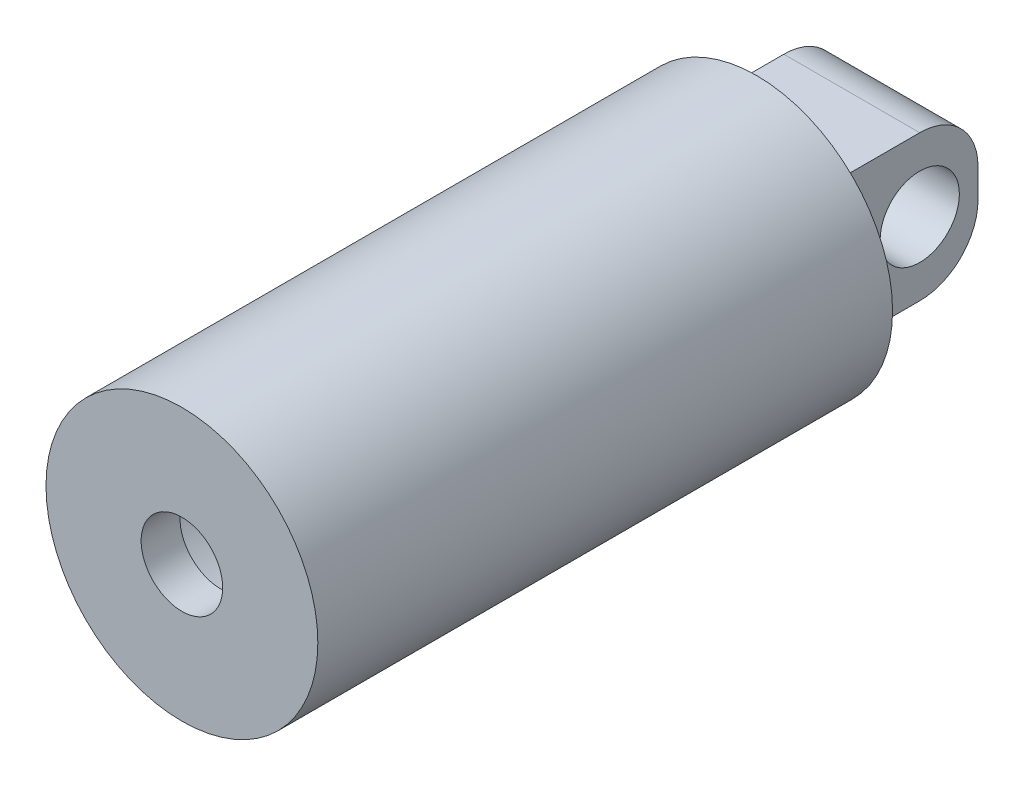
ISO-10303-21;
HEADER;
FILE_DESCRIPTION(('STEP AP214'),'2;1');
FILE_NAME('part.step','',(''),(''),'','','');
FILE_SCHEMA(('AUTOMOTIVE_DESIGN { 1 0 10303 214 1 1 1 1 }'));
ENDSEC;
DATA;
#1=APPLICATION_CONTEXT('core data for automotive mechanical design processes');
#2=APPLICATION_PROTOCOL_DEFINITION('international standard','automotive_design',2000,#1);
#3=PRODUCT_CONTEXT('',#1,'mechanical');
#4=PRODUCT('Part','Part','',(#3));
#5=PRODUCT_RELATED_PRODUCT_CATEGORY('part','',(#4));
#6=PRODUCT_DEFINITION_FORMATION('','',#4);
#7=PRODUCT_DEFINITION_CONTEXT('part definition',#1,'design');
#8=PRODUCT_DEFINITION('design','',#6,#7);
#9=PRODUCT_DEFINITION_SHAPE('','',#8);
#10=(LENGTH_UNIT() NAMED_UNIT(*) SI_UNIT(.MILLI.,.METRE.));
#11=(NAMED_UNIT(*) PLANE_ANGLE_UNIT() SI_UNIT($,.RADIAN.));
#12=(NAMED_UNIT(*) SI_UNIT($,.STERADIAN.) SOLID_ANGLE_UNIT());
#13=UNCERTAINTY_MEASURE_WITH_UNIT(LENGTH_MEASURE(1.E-05),#10,'distance_accuracy_value','');
#14=(GEOMETRIC_REPRESENTATION_CONTEXT(3) GLOBAL_UNCERTAINTY_ASSIGNED_CONTEXT((#13)) GLOBAL_UNIT_ASSIGNED_CONTEXT((#10,
#11,#12)) REPRESENTATION_CONTEXT('',''));
#15=CARTESIAN_POINT('',(0.,0.,0.));
#16=DIRECTION('',(0.,0.,1.));
#17=DIRECTION('',(1.,0.,0.));
#18=AXIS2_PLACEMENT_3D('',#15,#16,#17);
#19=CARTESIAN_POINT('',(0.,0.,-190.5));
#20=DIRECTION('',(0.,0.,1.));
#21=DIRECTION('',(1.,0.,0.));
#22=AXIS2_PLACEMENT_3D('',#19,#20,#21);
#23=CYLINDRICAL_SURFACE('',#22,44.45);
#24=CARTESIAN_POINT('',(0.,0.,0.));
#25=DIRECTION('',(0.,0.,1.));
#26=DIRECTION('',(1.,0.,0.));
#27=AXIS2_PLACEMENT_3D('',#24,#25,#26);
#28=CIRCLE('',#27,44.45);
#29=CARTESIAN_POINT('',(44.45,0.,0.));
#30=VERTEX_POINT('',#29);
#31=EDGE_CURVE('E142',#30,#30,#28,.T.);
#32=ORIENTED_EDGE('',*,*,#31,.F.);
#33=EDGE_LOOP('',(#32));
#34=FACE_BOUND('',#33,.T.);
#35=CARTESIAN_POINT('',(0.,0.,-187.96));
#36=DIRECTION('',(0.,0.,-1.));
#37=DIRECTION('',(-1.,0.,0.));
#38=AXIS2_PLACEMENT_3D('',#35,#36,#37);
#39=CIRCLE('',#38,44.45);
#40=CARTESIAN_POINT('',(-44.45,0.,-187.96));
#41=VERTEX_POINT('',#40);
#42=EDGE_CURVE('E114',#41,#41,#39,.T.);
#43=ORIENTED_EDGE('',*,*,#42,.F.);
#44=EDGE_LOOP('',(#43));
#45=FACE_BOUND('',#44,.T.);
#46=ADVANCED_FACE('F37',(#34,#45),#23,.T.);
#47=CARTESIAN_POINT('',(0.,0.,-190.5));
#48=DIRECTION('',(0.,0.,1.));
#49=DIRECTION('',(1.,0.,0.));
#50=AXIS2_PLACEMENT_3D('',#47,#48,#49);
#51=CYLINDRICAL_SURFACE('',#50,38.1);
#52=CARTESIAN_POINT('',(0.,0.,-12.7));
#53=DIRECTION('',(0.,0.,1.));
#54=DIRECTION('',(1.,0.,0.));
#55=AXIS2_PLACEMENT_3D('',#52,#53,#54);
#56=CIRCLE('',#55,38.1);
#57=CARTESIAN_POINT('',(38.1,0.,-12.7));
#58=VERTEX_POINT('',#57);
#59=EDGE_CURVE('E138',#58,#58,#56,.F.);
#60=ORIENTED_EDGE('',*,*,#59,.F.);
#61=EDGE_LOOP('',(#60));
#62=FACE_BOUND('',#61,.T.);
#63=CARTESIAN_POINT('',(0.,0.,-177.8));
#64=DIRECTION('',(0.,0.,-1.));
#65=DIRECTION('',(-1.,0.,0.));
#66=AXIS2_PLACEMENT_3D('',#63,#64,#65);
#67=CIRCLE('',#66,38.1);
#68=CARTESIAN_POINT('',(-38.1,0.,-177.8));
#69=VERTEX_POINT('',#68);
#70=EDGE_CURVE('E134',#69,#69,#67,.F.);
#71=ORIENTED_EDGE('',*,*,#70,.F.);
#72=EDGE_LOOP('',(#71));
#73=FACE_BOUND('',#72,.T.);
#74=ADVANCED_FACE('F185',(#62,#73),#51,.F.);
#75=CARTESIAN_POINT('',(0.,0.,0.));
#76=DIRECTION('',(0.,0.,1.));
#77=DIRECTION('',(1.,0.,0.));
#78=AXIS2_PLACEMENT_3D('',#75,#76,#77);
#79=PLANE('',#78);
#80=ORIENTED_EDGE('',*,*,#31,.T.);
#81=EDGE_LOOP('',(#80));
#82=FACE_BOUND('',#81,.T.);
#83=CARTESIAN_POINT('',(0.,0.,0.));
#84=DIRECTION('',(0.,0.,1.));
#85=DIRECTION('',(1.,0.,0.));
#86=AXIS2_PLACEMENT_3D('',#83,#84,#85);
#87=CIRCLE('',#86,13.335);
#88=CARTESIAN_POINT('',(13.335,0.,0.));
#89=VERTEX_POINT('',#88);
#90=EDGE_CURVE('E133',#89,#89,#87,.T.);
#91=ORIENTED_EDGE('',*,*,#90,.F.);
#92=EDGE_LOOP('',(#91));
#93=FACE_BOUND('',#92,.T.);
#94=ADVANCED_FACE('F193',(#82,#93),#79,.T.);
#95=CARTESIAN_POINT('',(0.,0.,-12.7));
#96=DIRECTION('',(0.,0.,1.));
#97=DIRECTION('',(1.,0.,0.));
#98=AXIS2_PLACEMENT_3D('',#95,#96,#97);
#99=PLANE('',#98);
#100=CARTESIAN_POINT('',(0.,0.,-12.7));
#101=DIRECTION('',(0.,0.,1.));
#102=DIRECTION('',(1.,0.,0.));
#103=AXIS2_PLACEMENT_3D('',#100,#101,#102);
#104=CIRCLE('',#103,13.335);
#105=CARTESIAN_POINT('',(13.335,0.,-12.7));
#106=VERTEX_POINT('',#105);
#107=EDGE_CURVE('E139',#106,#106,#104,.T.);
#108=ORIENTED_EDGE('',*,*,#107,.T.);
#109=EDGE_LOOP('',(#108));
#110=FACE_BOUND('',#109,.T.);
#111=ORIENTED_EDGE('',*,*,#59,.T.);
#112=EDGE_LOOP('',(#111));
#113=FACE_BOUND('',#112,.T.);
#114=ADVANCED_FACE('F225',(#110,#113),#99,.F.);
#115=CARTESIAN_POINT('',(0.,0.,-12.7));
#116=DIRECTION('',(0.,0.,1.));
#117=DIRECTION('',(1.,0.,0.));
#118=AXIS2_PLACEMENT_3D('',#115,#116,#117);
#119=CYLINDRICAL_SURFACE('',#118,13.335);
#120=ORIENTED_EDGE('',*,*,#107,.F.);
#121=EDGE_LOOP('',(#120));
#122=FACE_BOUND('',#121,.T.);
#123=ORIENTED_EDGE('',*,*,#90,.T.);
#124=EDGE_LOOP('',(#123));
#125=FACE_BOUND('',#124,.T.);
#126=ADVANCED_FACE('F219',(#122,#125),#119,.F.);
#127=CARTESIAN_POINT('',(0.,0.,-177.8));
#128=DIRECTION('',(0.,0.,-1.));
#129=DIRECTION('',(-1.,0.,0.));
#130=AXIS2_PLACEMENT_3D('',#127,#128,#129);
#131=PLANE('',#130);
#132=ORIENTED_EDGE('',*,*,#70,.T.);
#133=EDGE_LOOP('',(#132));
#134=FACE_BOUND('',#133,.T.);
#135=ADVANCED_FACE('F216',(#134),#131,.F.);
#136=CARTESIAN_POINT('',(0.,0.,-187.96));
#137=DIRECTION('',(0.,0.,-1.));
#138=DIRECTION('',(-1.,0.,0.));
#139=AXIS2_PLACEMENT_3D('',#136,#137,#138);
#140=PLANE('',#139);
#141=DIRECTION('',(1.,0.,0.));
#142=VECTOR('',#141,1.);
#143=CARTESIAN_POINT('',(-22.225,23.8125,-187.96));
#144=LINE('',#143,#142);
#145=CARTESIAN_POINT('',(-22.225,23.8125,-187.96));
#146=VERTEX_POINT('',#145);
#147=CARTESIAN_POINT('',(22.225,23.8125,-187.96));
#148=VERTEX_POINT('',#147);
#149=EDGE_CURVE('E112',#146,#148,#144,.T.);
#150=ORIENTED_EDGE('',*,*,#149,.F.);
#151=DIRECTION('',(0.,1.,0.));
#152=VECTOR('',#151,1.);
#153=CARTESIAN_POINT('',(-22.225,-23.8125,-187.96));
#154=LINE('',#153,#152);
#155=CARTESIAN_POINT('',(-22.225,-23.8125,-187.96));
#156=VERTEX_POINT('',#155);
#157=EDGE_CURVE('E106',#156,#146,#154,.T.);
#158=ORIENTED_EDGE('',*,*,#157,.F.);
#159=DIRECTION('',(-1.,0.,0.));
#160=VECTOR('',#159,1.);
#161=CARTESIAN_POINT('',(22.225,-23.8125,-187.96));
#162=LINE('',#161,#160);
#163=CARTESIAN_POINT('',(22.225,-23.8125,-187.96));
#164=VERTEX_POINT('',#163);
#165=EDGE_CURVE('E91',#164,#156,#162,.T.);
#166=ORIENTED_EDGE('',*,*,#165,.F.);
#167=DIRECTION('',(0.,-1.,0.));
#168=VECTOR('',#167,1.);
#169=CARTESIAN_POINT('',(22.225,23.8125,-187.96));
#170=LINE('',#169,#168);
#171=EDGE_CURVE('E103',#148,#164,#170,.T.);
#172=ORIENTED_EDGE('',*,*,#171,.F.);
#173=EDGE_LOOP('',(#150,#158,#166,#172));
#174=FACE_BOUND('',#173,.T.);
#175=ORIENTED_EDGE('',*,*,#42,.T.);
#176=EDGE_LOOP('',(#175));
#177=FACE_BOUND('',#176,.T.);
#178=ADVANCED_FACE('F101',(#174,#177),#140,.T.);
#179=CARTESIAN_POINT('',(0.,4.76249999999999,-219.075));
#180=DIRECTION('',(-1.,0.,0.));
#181=DIRECTION('',(0.,0.,1.));
#182=AXIS2_PLACEMENT_3D('',#179,#180,#181);
#183=CYLINDRICAL_SURFACE('',#182,19.05);
#184=CARTESIAN_POINT('',(-22.225,4.76249999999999,-219.075));
#185=DIRECTION('',(1.,0.,0.));
#186=DIRECTION('',(0.,1.,0.));
#187=AXIS2_PLACEMENT_3D('',#184,#185,#186);
#188=CIRCLE('',#187,19.05);
#189=CARTESIAN_POINT('',(-22.225,23.8125,-219.075));
#190=VERTEX_POINT('',#189);
#191=CARTESIAN_POINT('',(-22.225,4.76249999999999,-238.125));
#192=VERTEX_POINT('',#191);
#193=EDGE_CURVE('E154',#190,#192,#188,.F.);
#194=ORIENTED_EDGE('',*,*,#193,.F.);
#195=DIRECTION('',(1.,0.,0.));
#196=VECTOR('',#195,1.);
#197=CARTESIAN_POINT('',(-22.225,23.8125,-219.075));
#198=LINE('',#197,#196);
#199=CARTESIAN_POINT('',(22.225,23.8125,-219.075));
#200=VERTEX_POINT('',#199);
#201=EDGE_CURVE('E11',#200,#190,#198,.F.);
#202=ORIENTED_EDGE('',*,*,#201,.F.);
#203=CARTESIAN_POINT('',(22.225,4.76249999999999,-219.075));
#204=DIRECTION('',(-1.,0.,0.));
#205=DIRECTION('',(0.,-1.,0.));
#206=AXIS2_PLACEMENT_3D('',#203,#204,#205);
#207=CIRCLE('',#206,19.05);
#208=CARTESIAN_POINT('',(22.225,4.76249999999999,-238.125));
#209=VERTEX_POINT('',#208);
#210=EDGE_CURVE('E52',#209,#200,#207,.F.);
#211=ORIENTED_EDGE('',*,*,#210,.F.);
#212=DIRECTION('',(1.,0.,0.));
#213=VECTOR('',#212,1.);
#214=CARTESIAN_POINT('',(22.225,4.76249999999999,-238.125));
#215=LINE('',#214,#213);
#216=EDGE_CURVE('E137',#192,#209,#215,.T.);
#217=ORIENTED_EDGE('',*,*,#216,.F.);
#218=EDGE_LOOP('',(#194,#202,#211,#217));
#219=FACE_BOUND('',#218,.T.);
#220=ADVANCED_FACE('F39',(#219),#183,.T.);
#221=CARTESIAN_POINT('',(0.,0.,-238.125));
#222=DIRECTION('',(0.,0.,-1.));
#223=DIRECTION('',(-1.,0.,0.));
#224=AXIS2_PLACEMENT_3D('',#221,#222,#223);
#225=PLANE('',#224);
#226=DIRECTION('',(0.,-1.,0.));
#227=VECTOR('',#226,1.);
#228=CARTESIAN_POINT('',(22.225,23.8125,-238.125));
#229=LINE('',#228,#227);
#230=CARTESIAN_POINT('',(22.225,-4.76250000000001,-238.125));
#231=VERTEX_POINT('',#230);
#232=EDGE_CURVE('E126',#209,#231,#229,.T.);
#233=ORIENTED_EDGE('',*,*,#232,.T.);
#234=DIRECTION('',(-1.,0.,0.));
#235=VECTOR('',#234,1.);
#236=CARTESIAN_POINT('',(-22.225,-4.76250000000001,-238.125));
#237=LINE('',#236,#235);
#238=CARTESIAN_POINT('',(-22.225,-4.76250000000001,-238.125));
#239=VERTEX_POINT('',#238);
#240=EDGE_CURVE('E151',#231,#239,#237,.T.);
#241=ORIENTED_EDGE('',*,*,#240,.T.);
#242=DIRECTION('',(0.,1.,0.));
#243=VECTOR('',#242,1.);
#244=CARTESIAN_POINT('',(-22.225,23.8125,-238.125));
#245=LINE('',#244,#243);
#246=EDGE_CURVE('E123',#239,#192,#245,.T.);
#247=ORIENTED_EDGE('',*,*,#246,.T.);
#248=ORIENTED_EDGE('',*,*,#216,.T.);
#249=EDGE_LOOP('',(#233,#241,#247,#248));
#250=FACE_BOUND('',#249,.T.);
#251=ADVANCED_FACE('F162',(#250),#225,.T.);
#252=CARTESIAN_POINT('',(-32.385,0.,-219.075));
#253=DIRECTION('',(1.,0.,0.));
#254=DIRECTION('',(0.,1.,0.));
#255=AXIS2_PLACEMENT_3D('',#252,#253,#254);
#256=CYLINDRICAL_SURFACE('',#255,12.954);
#257=CARTESIAN_POINT('',(22.225,0.,-219.075));
#258=DIRECTION('',(1.,0.,0.));
#259=DIRECTION('',(0.,1.,0.));
#260=AXIS2_PLACEMENT_3D('',#257,#258,#259);
#261=CIRCLE('',#260,12.954);
#262=CARTESIAN_POINT('',(22.225,12.954,-219.075));
#263=VERTEX_POINT('',#262);
#264=EDGE_CURVE('E117',#263,#263,#261,.T.);
#265=ORIENTED_EDGE('',*,*,#264,.T.);
#266=EDGE_LOOP('',(#265));
#267=FACE_BOUND('',#266,.T.);
#268=CARTESIAN_POINT('',(-22.225,0.,-219.075));
#269=DIRECTION('',(1.,0.,0.));
#270=DIRECTION('',(0.,1.,0.));
#271=AXIS2_PLACEMENT_3D('',#268,#269,#270);
#272=CIRCLE('',#271,12.954);
#273=CARTESIAN_POINT('',(-22.225,12.954,-219.075));
#274=VERTEX_POINT('',#273);
#275=EDGE_CURVE('E120',#274,#274,#272,.T.);
#276=ORIENTED_EDGE('',*,*,#275,.F.);
#277=EDGE_LOOP('',(#276));
#278=FACE_BOUND('',#277,.T.);
#279=ADVANCED_FACE('F200',(#267,#278),#256,.F.);
#280=CARTESIAN_POINT('',(0.,-4.76250000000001,-219.075));
#281=DIRECTION('',(1.,0.,0.));
#282=DIRECTION('',(0.,0.,-1.));
#283=AXIS2_PLACEMENT_3D('',#280,#281,#282);
#284=CYLINDRICAL_SURFACE('',#283,19.05);
#285=CARTESIAN_POINT('',(22.225,-4.76250000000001,-219.075));
#286=DIRECTION('',(-1.,0.,0.));
#287=DIRECTION('',(0.,-1.,0.));
#288=AXIS2_PLACEMENT_3D('',#285,#286,#287);
#289=CIRCLE('',#288,19.05);
#290=CARTESIAN_POINT('',(22.225,-23.8125,-219.075));
#291=VERTEX_POINT('',#290);
#292=EDGE_CURVE('E45',#291,#231,#289,.F.);
#293=ORIENTED_EDGE('',*,*,#292,.F.);
#294=DIRECTION('',(-1.,0.,0.));
#295=VECTOR('',#294,1.);
#296=CARTESIAN_POINT('',(22.225,-23.8125,-219.075));
#297=LINE('',#296,#295);
#298=CARTESIAN_POINT('',(-22.225,-23.8125,-219.075));
#299=VERTEX_POINT('',#298);
#300=EDGE_CURVE('E60',#299,#291,#297,.F.);
#301=ORIENTED_EDGE('',*,*,#300,.F.);
#302=CARTESIAN_POINT('',(-22.225,-4.76250000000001,-219.075));
#303=DIRECTION('',(1.,0.,0.));
#304=DIRECTION('',(0.,1.,0.));
#305=AXIS2_PLACEMENT_3D('',#302,#303,#304);
#306=CIRCLE('',#305,19.05);
#307=EDGE_CURVE('E156',#239,#299,#306,.F.);
#308=ORIENTED_EDGE('',*,*,#307,.F.);
#309=ORIENTED_EDGE('',*,*,#240,.F.);
#310=EDGE_LOOP('',(#293,#301,#308,#309));
#311=FACE_BOUND('',#310,.T.);
#312=ADVANCED_FACE('F165',(#311),#284,.T.);
#313=CARTESIAN_POINT('',(22.225,-23.8125,-238.125));
#314=DIRECTION('',(0.,1.,0.));
#315=DIRECTION('',(0.,0.,1.));
#316=AXIS2_PLACEMENT_3D('',#313,#314,#315);
#317=PLANE('',#316);
#318=DIRECTION('',(0.,0.,1.));
#319=VECTOR('',#318,1.);
#320=CARTESIAN_POINT('',(-22.225,-23.8125,-238.125));
#321=LINE('',#320,#319);
#322=EDGE_CURVE('E95',#299,#156,#321,.T.);
#323=ORIENTED_EDGE('',*,*,#322,.F.);
#324=ORIENTED_EDGE('',*,*,#300,.T.);
#325=DIRECTION('',(0.,0.,1.));
#326=VECTOR('',#325,1.);
#327=CARTESIAN_POINT('',(22.225,-23.8125,-238.125));
#328=LINE('',#327,#326);
#329=EDGE_CURVE('E88',#291,#164,#328,.T.);
#330=ORIENTED_EDGE('',*,*,#329,.T.);
#331=ORIENTED_EDGE('',*,*,#165,.T.);
#332=EDGE_LOOP('',(#323,#324,#330,#331));
#333=FACE_BOUND('',#332,.T.);
#334=ADVANCED_FACE('F90',(#333),#317,.F.);
#335=CARTESIAN_POINT('',(22.225,23.8125,-238.125));
#336=DIRECTION('',(-1.,0.,0.));
#337=DIRECTION('',(0.,-1.,0.));
#338=AXIS2_PLACEMENT_3D('',#335,#336,#337);
#339=PLANE('',#338);
#340=ORIENTED_EDGE('',*,*,#264,.F.);
#341=EDGE_LOOP('',(#340));
#342=FACE_BOUND('',#341,.T.);
#343=ORIENTED_EDGE('',*,*,#329,.F.);
#344=ORIENTED_EDGE('',*,*,#292,.T.);
#345=ORIENTED_EDGE('',*,*,#232,.F.);
#346=ORIENTED_EDGE('',*,*,#210,.T.);
#347=DIRECTION('',(0.,0.,1.));
#348=VECTOR('',#347,1.);
#349=CARTESIAN_POINT('',(22.225,23.8125,-238.125));
#350=LINE('',#349,#348);
#351=EDGE_CURVE('E94',#200,#148,#350,.T.);
#352=ORIENTED_EDGE('',*,*,#351,.T.);
#353=ORIENTED_EDGE('',*,*,#171,.T.);
#354=EDGE_LOOP('',(#343,#344,#345,#346,#352,#353));
#355=FACE_BOUND('',#354,.T.);
#356=ADVANCED_FACE('F108',(#342,#355),#339,.F.);
#357=CARTESIAN_POINT('',(22.225,23.8125,-238.125));
#358=DIRECTION('',(0.,-1.,0.));
#359=DIRECTION('',(0.,0.,-1.));
#360=AXIS2_PLACEMENT_3D('',#357,#358,#359);
#361=PLANE('',#360);
#362=ORIENTED_EDGE('',*,*,#351,.F.);
#363=ORIENTED_EDGE('',*,*,#201,.T.);
#364=DIRECTION('',(0.,0.,1.));
#365=VECTOR('',#364,1.);
#366=CARTESIAN_POINT('',(-22.225,23.8125,-238.125));
#367=LINE('',#366,#365);
#368=EDGE_CURVE('E131',#190,#146,#367,.T.);
#369=ORIENTED_EDGE('',*,*,#368,.T.);
#370=ORIENTED_EDGE('',*,*,#149,.T.);
#371=EDGE_LOOP('',(#362,#363,#369,#370));
#372=FACE_BOUND('',#371,.T.);
#373=ADVANCED_FACE('F173',(#372),#361,.F.);
#374=CARTESIAN_POINT('',(-22.225,23.8125,-238.125));
#375=DIRECTION('',(1.,0.,0.));
#376=DIRECTION('',(0.,1.,0.));
#377=AXIS2_PLACEMENT_3D('',#374,#375,#376);
#378=PLANE('',#377);
#379=ORIENTED_EDGE('',*,*,#275,.T.);
#380=EDGE_LOOP('',(#379));
#381=FACE_BOUND('',#380,.T.);
#382=ORIENTED_EDGE('',*,*,#246,.F.);
#383=ORIENTED_EDGE('',*,*,#307,.T.);
#384=ORIENTED_EDGE('',*,*,#322,.T.);
#385=ORIENTED_EDGE('',*,*,#157,.T.);
#386=ORIENTED_EDGE('',*,*,#368,.F.);
#387=ORIENTED_EDGE('',*,*,#193,.T.);
#388=EDGE_LOOP('',(#382,#383,#384,#385,#386,#387));
#389=FACE_BOUND('',#388,.T.);
#390=ADVANCED_FACE('F167',(#381,#389),#378,.F.);
#391=CLOSED_SHELL('',(#46,#74,#94,#114,#126,#135,#178,#220,#251,#279,#312,#334,#356,#373,#390));
#392=MANIFOLD_SOLID_BREP('B2',#391);
#393=ADVANCED_BREP_SHAPE_REPRESENTATION('',(#18,#392),#14);
#394=SHAPE_DEFINITION_REPRESENTATION(#9,#393);
ENDSEC;
END-ISO-10303-21;
